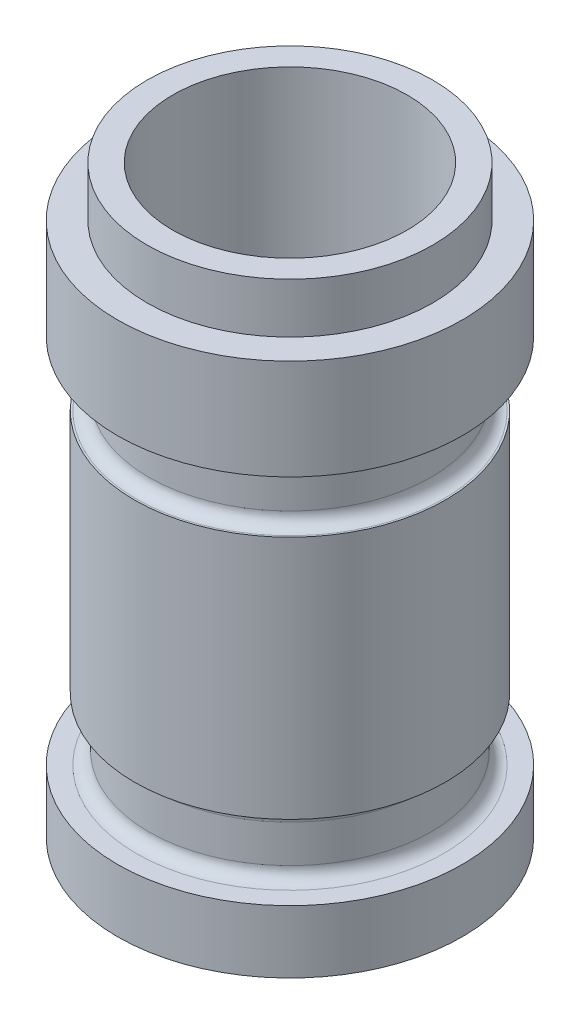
from build123d import *


with BuildPart() as part:
    # Sketch1 → Revolve1 (revolve)
    with BuildSketch(Plane.XY, mode=Mode.PRIVATE) as revolve1_sk:
        with BuildLine():
            Line((0, 0), (0, 0.5))
            Line((0, 0.5), (1.37, 0.987858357))
            Line((1.37, 0.987858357), (1.87, 0.987858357))
            Line((1.87, 0.987858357), (1.87, 9.324006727))
            Line((1.87, 9.324006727), (2.28, 9.324006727))
            Line((2.28, 9.324006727), (2.28, 8.524006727))
            Line((2.28, 8.524006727), (2.75, 8.524006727))
            Line((2.75, 8.524006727), (2.75, 6.924006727))
            Line((2.75, 6.924006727), (2.45, 6.924006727))
            ThreePointArc((2.45, 6.924006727), (2.308578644, 6.865428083), (2.25, 6.724006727))
            Line((2.25, 6.724006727), (2.25, 6.1))
            ThreePointArc((2.25, 6.1), (2.308578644, 5.958578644), (2.45, 5.9))
            Line((2.45, 5.9), (2.479, 5.9))
            Line((2.479, 5.9), (2.479, 2))
            Line((2.479, 2), (2.45, 2))
            ThreePointArc((2.45, 2), (2.308578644, 1.941421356), (2.25, 1.8))
            Line((2.25, 1.8), (2.25, 1.2))
            ThreePointArc((2.25, 1.2), (2.308578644, 1.058578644), (2.45, 1))
            Line((2.45, 1), (2.75, 1))
            Line((2.75, 1), (2.75, 0))
            Line((2.75, 0), (0, 0))
        make_face()
    revolve(revolve1_sk.sketch.rotate(Axis((0, 236.22, 0), (0, -1, 0)), 90), axis=Axis((0, 236.22, 0), (0, -1, 0)))


solid = part.part
